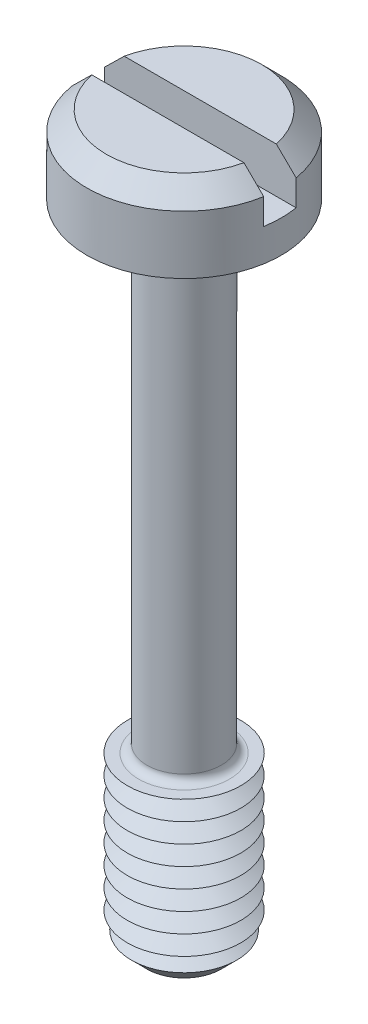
from build123d import *

# Parameters (mm, degrees)
SKETCH1_R           = 3
BOSS_EXTRUDE1_DEPTH = 2.4
SKETCH2_R           = 1.15
BOSS_EXTRUDE2_DEPTH = 20
SKETCH3_R           = 1.75
BOSS_EXTRUDE3_DEPTH = 5.2
CHAMFER1_SIZE       = 0.6
LPATTERN1_COUNT     = 8
LPATTERN1_PITCH     = 0.6
FILLET1_R           = 0.25
CHAMFER2_SIZE       = 0.6
SKETCH6_W           = 6
SKETCH6_H           = 1
CUT_EXTRUDE1_DEPTH  = 1.4


with BuildPart() as part:
    # Sketch1 → Boss-Extrude1 (new body)
    with BuildSketch(Plane(origin=(0, 0, 0), x_dir=(1, 0, 0), z_dir=(0, 1, 0))):
        with Locations(Location((0, 0, 0), (0, 0, 270))):
            Circle(SKETCH1_R)
    extrude(amount=BOSS_EXTRUDE1_DEPTH)

    # Sketch2 → Boss-Extrude2 (add)
    with BuildSketch(Plane.XZ):
        with Locations(Location((0, 0, 0), (0, 0, 270))):
            Circle(SKETCH2_R)
    extrude(amount=BOSS_EXTRUDE2_DEPTH)

    # Sketch3 → Boss-Extrude3 (add)
    with BuildSketch(Plane.XZ.offset(20)):
        with Locations(Location((0, 0, 0), (0, 0, 270))):
            Circle(SKETCH3_R)
    extrude(amount=-BOSS_EXTRUDE3_DEPTH)

    # Chamfer1
    chamfer1_edges = [part.edges().sort_by_distance(p)[0] for p in [
        (0, -20, 1.75),
    ]]
    chamfer(chamfer1_edges, length=CHAMFER1_SIZE)

    # Sketch5 → Cut-Revolve1 (revolve, cut)
    with BuildSketch(Plane(origin=(0, 0, 0), x_dir=(0, 0, -1), z_dir=(1, 0, 0))):
        Polygon((-1.75, -14.8), (-1.230384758, -15.1), (-1.75, -15.4), align=None)
    cut_revolve1 = revolve(axis=Axis((0, -6.58711856, 0), (0, -1, 0)), mode=Mode.SUBTRACT)

    # LPattern1: Cut-Revolve1 ×8
    with Locations(*[(0, -i * LPATTERN1_PITCH, 0) for i in range(1, LPATTERN1_COUNT)]):
        add(cut_revolve1, mode=Mode.SUBTRACT)

    # Fillet1
    fillet1_edges = [part.edges().sort_by_distance(p)[0] for p in [
        (0, 0, 1.15),
        (0, -14.8, 1.15),
    ]]
    fillet(fillet1_edges, radius=FILLET1_R)

    # Chamfer2
    chamfer2_edges = [part.edges().sort_by_distance(p)[0] for p in [
        (0, 2.4, -3),
    ]]
    chamfer(chamfer2_edges, length=CHAMFER2_SIZE)

    # Sketch6 → Cut-Extrude1 (cut)
    with BuildSketch(Plane(origin=(0, 2.4, 0), x_dir=(1, 0, 0), z_dir=(0, 1, 0))):
        Rectangle(SKETCH6_W, SKETCH6_H)
    extrude(amount=-CUT_EXTRUDE1_DEPTH, mode=Mode.SUBTRACT)


solid = part.part
